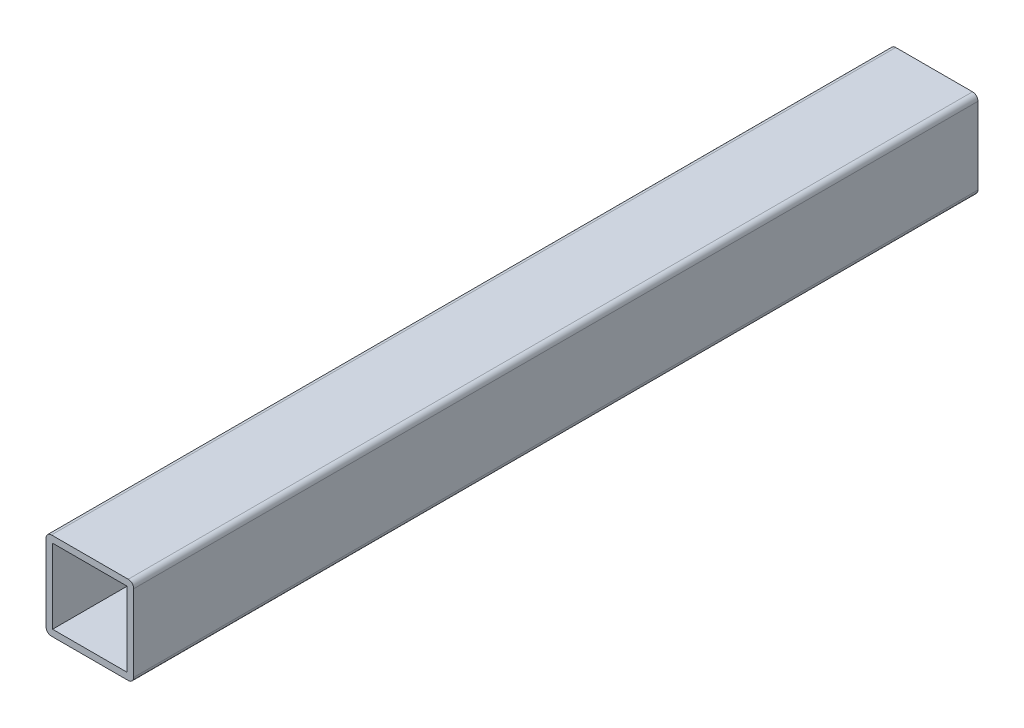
from build123d import *

# Parameters (mm, degrees)
ESQUISSE1_W        = 80
ESQUISSE1_H        = 80
ESQUISSE1_W_2      = 68
ESQUISSE1_H_2      = 68
EXTRU_MINCE1_DEPTH = 770
CONG_1_R           = 5


with BuildPart() as part:
    # Esquisse1 → Extru.-Mince1 (new body)
    with BuildSketch(Plane.XY):
        with Locations((40, -40)):
            Rectangle(ESQUISSE1_W, ESQUISSE1_H)
        with Locations((40, -40)):
            Rectangle(ESQUISSE1_W_2, ESQUISSE1_H_2, mode=Mode.SUBTRACT)
    extrude(amount=EXTRU_MINCE1_DEPTH)

    # Cong_1
    cong_1_edges = [part.edges().sort_by_distance(p)[0] for p in [
        (0, 0, 385),
        (80, 0, 385),
        (80, -80, 385),
        (0, -80, 385),
    ]]
    fillet(cong_1_edges, radius=CONG_1_R)


solid = part.part
